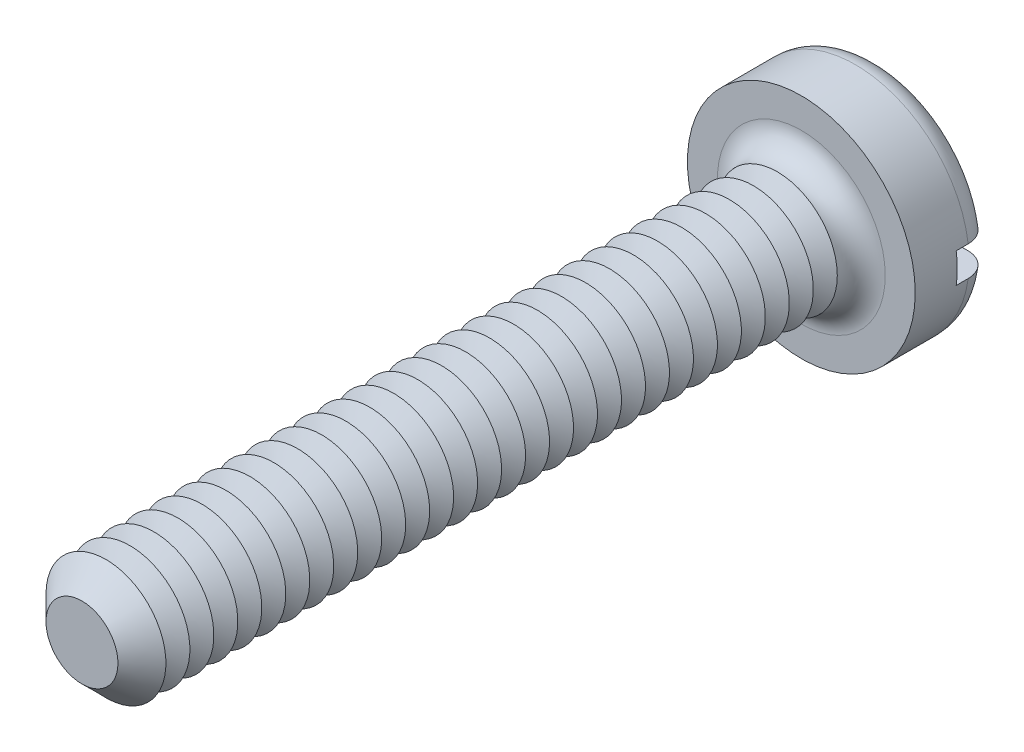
from build123d import *

# Parameters (mm, degrees)
SKETCH3_R           = 1.9
BOSS_EXTRUDE2_DEPTH = 1.3
SKETCH4_R           = 1
BOSS_EXTRUDE3_DEPTH = 12
FILLET1_R           = 0.4
CHAMFER1_SIZE       = 0.4
LPATTERN1_COUNT     = 28
LPATTERN1_PITCH     = 0.4
SKETCH8_W           = 3.8
SKETCH8_H           = 0.5
CUT_EXTRUDE1_DEPTH  = 0.6


with BuildPart() as part:
    # Sketch3 → Boss-Extrude2 (new body)
    with BuildSketch(Plane.XY):
        Circle(SKETCH3_R)
    extrude(amount=-BOSS_EXTRUDE2_DEPTH)

    # Sketch4 → Boss-Extrude3 (add)
    with BuildSketch(Plane.XY):
        Circle(SKETCH4_R)
    extrude(amount=BOSS_EXTRUDE3_DEPTH)

    # Fillet1
    fillet1_edges = [part.edges().sort_by_distance(p)[0] for p in [
        (-1.9, 0, -1.3),
        (-1, 0, 0),
    ]]
    fillet(fillet1_edges, radius=FILLET1_R)

    # Chamfer1
    chamfer1_edges = [part.edges().sort_by_distance(p)[0] for p in [
        (-1, 0, 12),
    ]]
    chamfer(chamfer1_edges, length=CHAMFER1_SIZE)

    # Sketch6 → Cut-Revolve1 (revolve, cut)
    with BuildSketch(Plane(origin=(0, 0, 0), x_dir=(0, 0, -1), z_dir=(1, 0, 0)), mode=Mode.PRIVATE) as cut_revolve1_sk:
        Polygon((-0.4, 1), (-0.6, 0.653589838), (-0.8, 1), align=None)
    cut_revolve1 = revolve(cut_revolve1_sk.sketch.rotate(Axis((0, 0, -1.694361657), (0, 0, 1)), 90), axis=Axis((0, 0, -1.694361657), (0, 0, 1)), mode=Mode.SUBTRACT)

    # LPattern1: Cut-Revolve1 ×28
    with Locations(*[(0, 0, i * LPATTERN1_PITCH) for i in range(1, LPATTERN1_COUNT)]):
        add(cut_revolve1, mode=Mode.SUBTRACT)

    # Sketch8 → Cut-Extrude1 (cut)
    with BuildSketch(Plane(origin=(0, 0, -1.3), x_dir=(-1, 0, 0), z_dir=(0, 0, -1))):
        Rectangle(SKETCH8_W, SKETCH8_H)
    extrude(amount=-CUT_EXTRUDE1_DEPTH, mode=Mode.SUBTRACT)


solid = part.part
